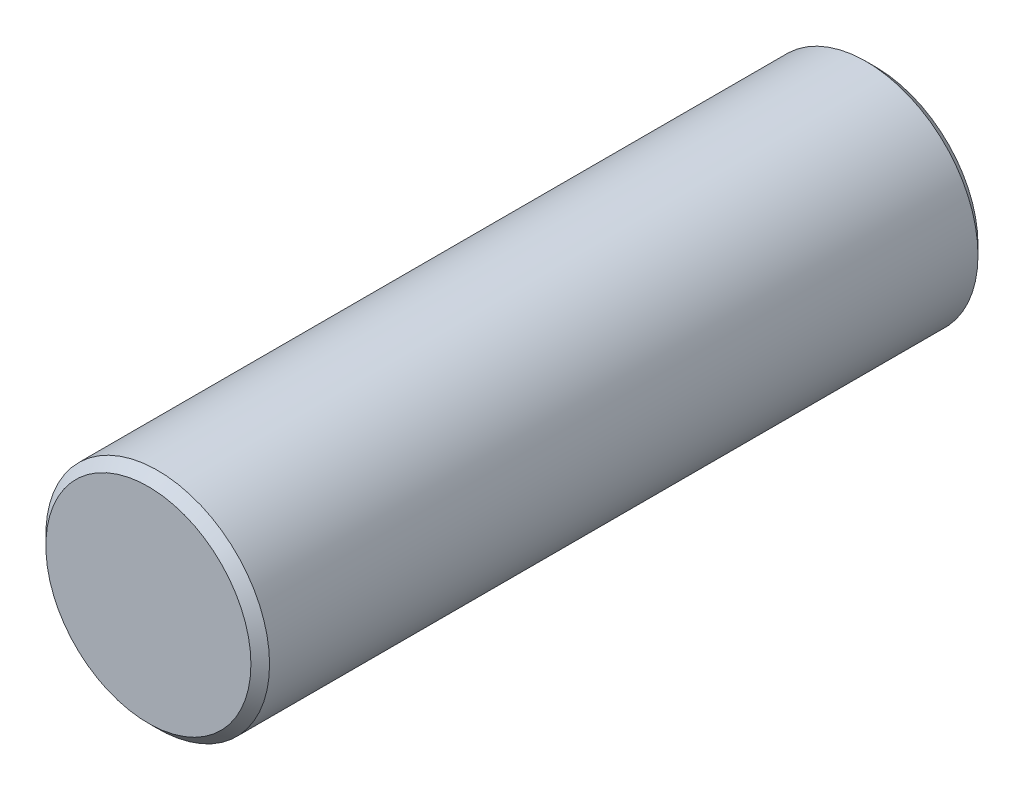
from build123d import *

# Parameters (mm, degrees)
ESQUISSE1_R     = 6
CYLINDRE_DEPTH  = 19.5
CHANFREIN1_SIZE = 0.5


with BuildPart() as part:
    # Esquisse1 → cylindre (new, symmetric)
    with BuildSketch(Plane.XY):
        with Locations((-183.814037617, 43.426415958)):
            Circle(ESQUISSE1_R)
    extrude(amount=CYLINDRE_DEPTH, both=True)

    # Chanfrein1
    chanfrein1_edges = [part.edges().sort_by_distance(p)[0] for p in [
        (-189.814037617, 43.426415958, -19.5),
        (-189.814037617, 43.426415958, 19.5),
    ]]
    chamfer(chanfrein1_edges, length=CHANFREIN1_SIZE)


solid = part.part
